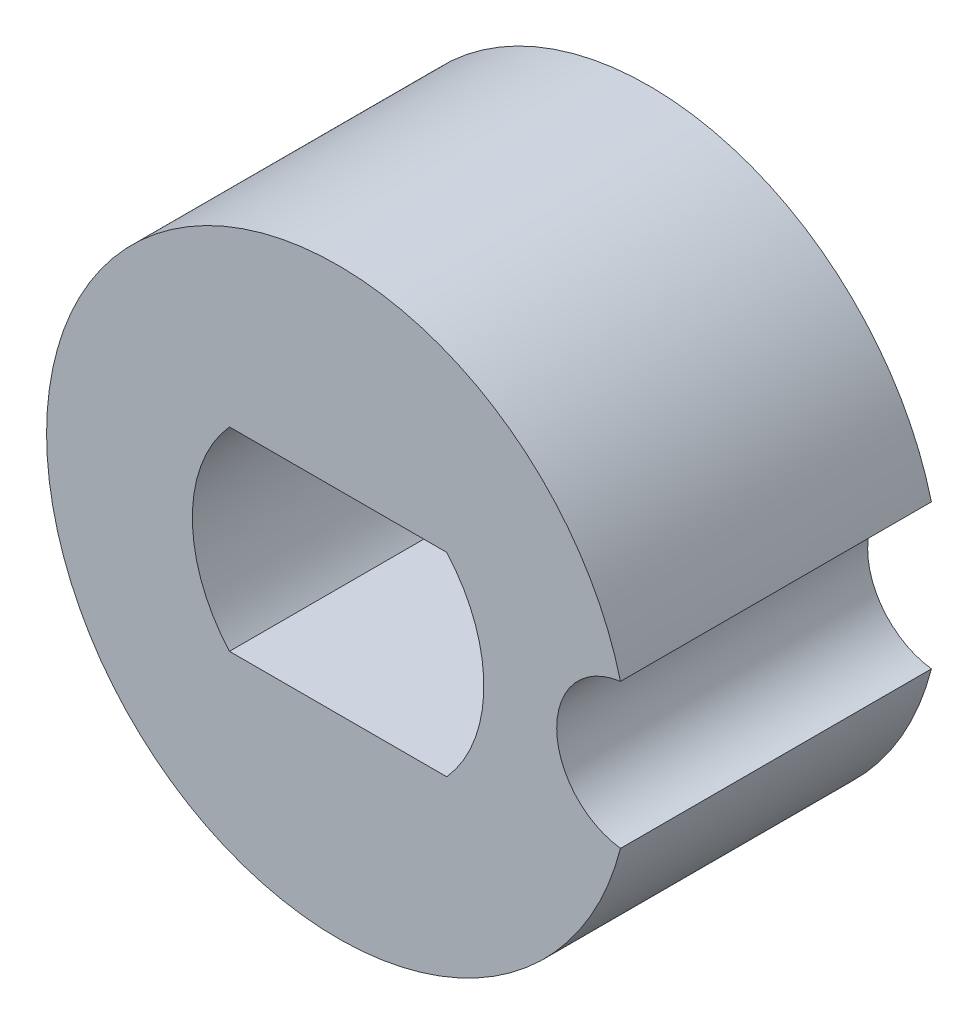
ISO-10303-21;
HEADER;
FILE_DESCRIPTION(('STEP AP214'),'2;1');
FILE_NAME('part.step','',(''),(''),'','','');
FILE_SCHEMA(('AUTOMOTIVE_DESIGN { 1 0 10303 214 1 1 1 1 }'));
ENDSEC;
DATA;
#1=APPLICATION_CONTEXT('core data for automotive mechanical design processes');
#2=APPLICATION_PROTOCOL_DEFINITION('international standard','automotive_design',2000,#1);
#3=PRODUCT_CONTEXT('',#1,'mechanical');
#4=PRODUCT('Part','Part','',(#3));
#5=PRODUCT_RELATED_PRODUCT_CATEGORY('part','',(#4));
#6=PRODUCT_DEFINITION_FORMATION('','',#4);
#7=PRODUCT_DEFINITION_CONTEXT('part definition',#1,'design');
#8=PRODUCT_DEFINITION('design','',#6,#7);
#9=PRODUCT_DEFINITION_SHAPE('','',#8);
#10=(LENGTH_UNIT() NAMED_UNIT(*) SI_UNIT(.MILLI.,.METRE.));
#11=(NAMED_UNIT(*) PLANE_ANGLE_UNIT() SI_UNIT($,.RADIAN.));
#12=(NAMED_UNIT(*) SI_UNIT($,.STERADIAN.) SOLID_ANGLE_UNIT());
#13=UNCERTAINTY_MEASURE_WITH_UNIT(LENGTH_MEASURE(1.E-05),#10,'distance_accuracy_value','');
#14=(GEOMETRIC_REPRESENTATION_CONTEXT(3) GLOBAL_UNCERTAINTY_ASSIGNED_CONTEXT((#13)) GLOBAL_UNIT_ASSIGNED_CONTEXT((#10,
#11,#12)) REPRESENTATION_CONTEXT('',''));
#15=CARTESIAN_POINT('',(0.,0.,0.));
#16=DIRECTION('',(0.,0.,1.));
#17=DIRECTION('',(1.,0.,0.));
#18=AXIS2_PLACEMENT_3D('',#15,#16,#17);
#19=CARTESIAN_POINT('',(4.7625,0.,10.16));
#20=DIRECTION('',(0.,0.,1.));
#21=DIRECTION('',(1.,0.,0.));
#22=AXIS2_PLACEMENT_3D('',#19,#20,#21);
#23=PLANE('',#22);
#24=CARTESIAN_POINT('',(0.,0.,10.16));
#25=DIRECTION('',(0.,0.,1.));
#26=DIRECTION('',(1.,0.,0.));
#27=AXIS2_PLACEMENT_3D('',#24,#25,#26);
#28=CIRCLE('',#27,9.525);
#29=CARTESIAN_POINT('',(9.22734375,2.36257324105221,10.16));
#30=VERTEX_POINT('',#29);
#31=CARTESIAN_POINT('',(9.22734375,-2.36257324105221,10.16));
#32=VERTEX_POINT('',#31);
#33=EDGE_CURVE('E108',#30,#32,#28,.T.);
#34=ORIENTED_EDGE('',*,*,#33,.T.);
#35=CARTESIAN_POINT('',(9.525,0.,10.16));
#36=DIRECTION('',(0.,0.,1.));
#37=DIRECTION('',(1.,0.,0.));
#38=AXIS2_PLACEMENT_3D('',#35,#36,#37);
#39=CIRCLE('',#38,2.38125);
#40=EDGE_CURVE('E111',#30,#32,#39,.T.);
#41=ORIENTED_EDGE('',*,*,#40,.F.);
#42=EDGE_LOOP('',(#34,#41));
#43=FACE_BOUND('',#42,.T.);
#44=DIRECTION('',(-1.,0.,0.));
#45=VECTOR('',#44,1.);
#46=CARTESIAN_POINT('',(3.54975791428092,-3.175,10.16));
#47=LINE('',#46,#45);
#48=CARTESIAN_POINT('',(3.54975791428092,-3.175,10.16));
#49=VERTEX_POINT('',#48);
#50=CARTESIAN_POINT('',(-3.54975791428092,-3.175,10.16));
#51=VERTEX_POINT('',#50);
#52=EDGE_CURVE('E92',#49,#51,#47,.T.);
#53=ORIENTED_EDGE('',*,*,#52,.T.);
#54=CARTESIAN_POINT('',(0.,0.,10.16));
#55=DIRECTION('',(0.,0.,1.));
#56=DIRECTION('',(1.,0.,0.));
#57=AXIS2_PLACEMENT_3D('',#54,#55,#56);
#58=CIRCLE('',#57,4.7625);
#59=CARTESIAN_POINT('',(-3.54975791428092,3.175,10.16));
#60=VERTEX_POINT('',#59);
#61=EDGE_CURVE('E68',#60,#51,#58,.T.);
#62=ORIENTED_EDGE('',*,*,#61,.F.);
#63=DIRECTION('',(-1.,0.,0.));
#64=VECTOR('',#63,1.);
#65=CARTESIAN_POINT('',(3.54975791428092,3.175,10.16));
#66=LINE('',#65,#64);
#67=CARTESIAN_POINT('',(3.54975791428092,3.175,10.16));
#68=VERTEX_POINT('',#67);
#69=EDGE_CURVE('E95',#68,#60,#66,.T.);
#70=ORIENTED_EDGE('',*,*,#69,.F.);
#71=CARTESIAN_POINT('',(0.,0.,10.16));
#72=DIRECTION('',(0.,0.,1.));
#73=DIRECTION('',(1.,0.,0.));
#74=AXIS2_PLACEMENT_3D('',#71,#72,#73);
#75=CIRCLE('',#74,4.7625);
#76=EDGE_CURVE('E29',#49,#68,#75,.T.);
#77=ORIENTED_EDGE('',*,*,#76,.F.);
#78=EDGE_LOOP('',(#53,#62,#70,#77));
#79=FACE_BOUND('',#78,.T.);
#80=ADVANCED_FACE('F14',(#43,#79),#23,.T.);
#81=CARTESIAN_POINT('',(4.7625,0.,0.));
#82=DIRECTION('',(0.,0.,1.));
#83=DIRECTION('',(1.,0.,0.));
#84=AXIS2_PLACEMENT_3D('',#81,#82,#83);
#85=PLANE('',#84);
#86=CARTESIAN_POINT('',(0.,0.,0.));
#87=DIRECTION('',(0.,0.,1.));
#88=DIRECTION('',(1.,0.,0.));
#89=AXIS2_PLACEMENT_3D('',#86,#87,#88);
#90=CIRCLE('',#89,9.525);
#91=CARTESIAN_POINT('',(9.22734375,2.36257324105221,0.));
#92=VERTEX_POINT('',#91);
#93=CARTESIAN_POINT('',(9.22734375,-2.36257324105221,0.));
#94=VERTEX_POINT('',#93);
#95=EDGE_CURVE('E72',#92,#94,#90,.T.);
#96=ORIENTED_EDGE('',*,*,#95,.F.);
#97=CARTESIAN_POINT('',(9.525,0.,0.));
#98=DIRECTION('',(0.,0.,1.));
#99=DIRECTION('',(1.,0.,0.));
#100=AXIS2_PLACEMENT_3D('',#97,#98,#99);
#101=CIRCLE('',#100,2.38125);
#102=EDGE_CURVE('E105',#92,#94,#101,.T.);
#103=ORIENTED_EDGE('',*,*,#102,.T.);
#104=EDGE_LOOP('',(#96,#103));
#105=FACE_BOUND('',#104,.T.);
#106=CARTESIAN_POINT('',(0.,0.,0.));
#107=DIRECTION('',(0.,0.,1.));
#108=DIRECTION('',(1.,0.,0.));
#109=AXIS2_PLACEMENT_3D('',#106,#107,#108);
#110=CIRCLE('',#109,4.7625);
#111=CARTESIAN_POINT('',(-3.54975791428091,3.175,0.));
#112=VERTEX_POINT('',#111);
#113=CARTESIAN_POINT('',(-3.54975791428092,-3.175,0.));
#114=VERTEX_POINT('',#113);
#115=EDGE_CURVE('E37',#112,#114,#110,.T.);
#116=ORIENTED_EDGE('',*,*,#115,.T.);
#117=DIRECTION('',(-1.,0.,0.));
#118=VECTOR('',#117,1.);
#119=CARTESIAN_POINT('',(3.54975791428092,-3.175,0.));
#120=LINE('',#119,#118);
#121=CARTESIAN_POINT('',(3.54975791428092,-3.175,0.));
#122=VERTEX_POINT('',#121);
#123=EDGE_CURVE('E76',#122,#114,#120,.T.);
#124=ORIENTED_EDGE('',*,*,#123,.F.);
#125=CARTESIAN_POINT('',(0.,0.,0.));
#126=DIRECTION('',(0.,0.,1.));
#127=DIRECTION('',(1.,0.,0.));
#128=AXIS2_PLACEMENT_3D('',#125,#126,#127);
#129=CIRCLE('',#128,4.7625);
#130=CARTESIAN_POINT('',(3.54975791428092,3.175,0.));
#131=VERTEX_POINT('',#130);
#132=EDGE_CURVE('E81',#122,#131,#129,.T.);
#133=ORIENTED_EDGE('',*,*,#132,.T.);
#134=DIRECTION('',(-1.,0.,0.));
#135=VECTOR('',#134,1.);
#136=CARTESIAN_POINT('',(3.54975791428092,3.175,0.));
#137=LINE('',#136,#135);
#138=EDGE_CURVE('E86',#131,#112,#137,.T.);
#139=ORIENTED_EDGE('',*,*,#138,.T.);
#140=EDGE_LOOP('',(#116,#124,#133,#139));
#141=FACE_BOUND('',#140,.T.);
#142=ADVANCED_FACE('F84',(#105,#141),#85,.F.);
#143=CARTESIAN_POINT('',(0.,0.,10.16));
#144=DIRECTION('',(0.,0.,-1.));
#145=DIRECTION('',(-1.,0.,0.));
#146=AXIS2_PLACEMENT_3D('',#143,#144,#145);
#147=CYLINDRICAL_SURFACE('',#146,9.525);
#148=DIRECTION('',(0.,0.,-1.));
#149=VECTOR('',#148,1.);
#150=CARTESIAN_POINT('',(9.22734375,-2.36257324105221,10.16));
#151=LINE('',#150,#149);
#152=EDGE_CURVE('E9',#32,#94,#151,.T.);
#153=ORIENTED_EDGE('',*,*,#152,.F.);
#154=ORIENTED_EDGE('',*,*,#33,.F.);
#155=DIRECTION('',(0.,0.,-1.));
#156=VECTOR('',#155,1.);
#157=CARTESIAN_POINT('',(9.22734375,2.36257324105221,10.16));
#158=LINE('',#157,#156);
#159=EDGE_CURVE('E22',#30,#92,#158,.T.);
#160=ORIENTED_EDGE('',*,*,#159,.T.);
#161=ORIENTED_EDGE('',*,*,#95,.T.);
#162=EDGE_LOOP('',(#153,#154,#160,#161));
#163=FACE_BOUND('',#162,.T.);
#164=ADVANCED_FACE('F116',(#163),#147,.T.);
#165=CARTESIAN_POINT('',(9.525,0.,10.16));
#166=DIRECTION('',(0.,0.,-1.));
#167=DIRECTION('',(-1.,0.,0.));
#168=AXIS2_PLACEMENT_3D('',#165,#166,#167);
#169=CYLINDRICAL_SURFACE('',#168,2.38125);
#170=ORIENTED_EDGE('',*,*,#40,.T.);
#171=ORIENTED_EDGE('',*,*,#152,.T.);
#172=ORIENTED_EDGE('',*,*,#102,.F.);
#173=ORIENTED_EDGE('',*,*,#159,.F.);
#174=EDGE_LOOP('',(#170,#171,#172,#173));
#175=FACE_BOUND('',#174,.T.);
#176=ADVANCED_FACE('F16',(#175),#169,.F.);
#177=CARTESIAN_POINT('',(0.,0.,10.16));
#178=DIRECTION('',(0.,0.,-1.));
#179=DIRECTION('',(-1.,0.,0.));
#180=AXIS2_PLACEMENT_3D('',#177,#178,#179);
#181=CYLINDRICAL_SURFACE('',#180,4.7625);
#182=DIRECTION('',(0.,0.,-1.));
#183=VECTOR('',#182,1.);
#184=CARTESIAN_POINT('',(-3.54975791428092,-3.175,10.16));
#185=LINE('',#184,#183);
#186=EDGE_CURVE('E64',#51,#114,#185,.T.);
#187=ORIENTED_EDGE('',*,*,#186,.T.);
#188=ORIENTED_EDGE('',*,*,#115,.F.);
#189=DIRECTION('',(0.,0.,-1.));
#190=VECTOR('',#189,1.);
#191=CARTESIAN_POINT('',(-3.54975791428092,3.175,10.16));
#192=LINE('',#191,#190);
#193=EDGE_CURVE('E98',#60,#112,#192,.T.);
#194=ORIENTED_EDGE('',*,*,#193,.F.);
#195=ORIENTED_EDGE('',*,*,#61,.T.);
#196=EDGE_LOOP('',(#187,#188,#194,#195));
#197=FACE_BOUND('',#196,.T.);
#198=ADVANCED_FACE('F66',(#197),#181,.F.);
#199=CARTESIAN_POINT('',(3.54975791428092,-3.175,10.16));
#200=DIRECTION('',(0.,-1.,0.));
#201=DIRECTION('',(1.,0.,0.));
#202=AXIS2_PLACEMENT_3D('',#199,#200,#201);
#203=PLANE('',#202);
#204=DIRECTION('',(0.,0.,-1.));
#205=VECTOR('',#204,1.);
#206=CARTESIAN_POINT('',(3.54975791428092,-3.175,10.16));
#207=LINE('',#206,#205);
#208=EDGE_CURVE('E73',#49,#122,#207,.T.);
#209=ORIENTED_EDGE('',*,*,#208,.T.);
#210=ORIENTED_EDGE('',*,*,#123,.T.);
#211=ORIENTED_EDGE('',*,*,#186,.F.);
#212=ORIENTED_EDGE('',*,*,#52,.F.);
#213=EDGE_LOOP('',(#209,#210,#211,#212));
#214=FACE_BOUND('',#213,.T.);
#215=ADVANCED_FACE('F77',(#214),#203,.F.);
#216=CARTESIAN_POINT('',(0.,0.,10.16));
#217=DIRECTION('',(0.,0.,-1.));
#218=DIRECTION('',(-1.,0.,0.));
#219=AXIS2_PLACEMENT_3D('',#216,#217,#218);
#220=CYLINDRICAL_SURFACE('',#219,4.7625);
#221=DIRECTION('',(0.,0.,-1.));
#222=VECTOR('',#221,1.);
#223=CARTESIAN_POINT('',(3.54975791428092,3.175,10.16));
#224=LINE('',#223,#222);
#225=EDGE_CURVE('E100',#68,#131,#224,.T.);
#226=ORIENTED_EDGE('',*,*,#225,.T.);
#227=ORIENTED_EDGE('',*,*,#132,.F.);
#228=ORIENTED_EDGE('',*,*,#208,.F.);
#229=ORIENTED_EDGE('',*,*,#76,.T.);
#230=EDGE_LOOP('',(#226,#227,#228,#229));
#231=FACE_BOUND('',#230,.T.);
#232=ADVANCED_FACE('F128',(#231),#220,.F.);
#233=CARTESIAN_POINT('',(3.54975791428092,3.175,10.16));
#234=DIRECTION('',(0.,-1.,0.));
#235=DIRECTION('',(1.,0.,0.));
#236=AXIS2_PLACEMENT_3D('',#233,#234,#235);
#237=PLANE('',#236);
#238=ORIENTED_EDGE('',*,*,#69,.T.);
#239=ORIENTED_EDGE('',*,*,#193,.T.);
#240=ORIENTED_EDGE('',*,*,#138,.F.);
#241=ORIENTED_EDGE('',*,*,#225,.F.);
#242=EDGE_LOOP('',(#238,#239,#240,#241));
#243=FACE_BOUND('',#242,.T.);
#244=ADVANCED_FACE('F127',(#243),#237,.T.);
#245=CLOSED_SHELL('',(#80,#142,#164,#176,#198,#215,#232,#244));
#246=MANIFOLD_SOLID_BREP('B1',#245);
#247=ADVANCED_BREP_SHAPE_REPRESENTATION('',(#18,#246),#14);
#248=SHAPE_DEFINITION_REPRESENTATION(#9,#247);
ENDSEC;
END-ISO-10303-21;
